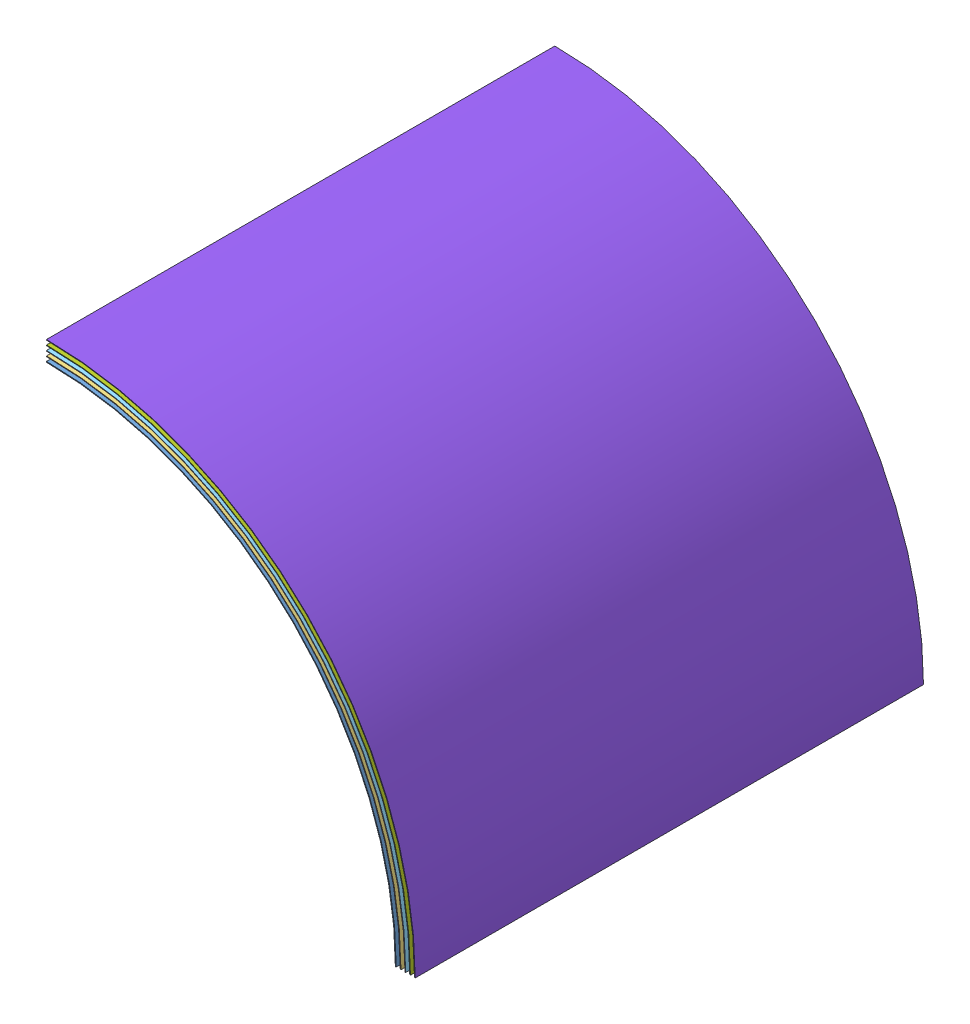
SolidWorks assembly NASA RASC-AL Whipple Shiled PRTYv3.SLDASM, configuration Default (file format 13000). Lengths in mm.
Overall size (2176 2176 3000).
8 component instances, 8 part files, 21 mates.
Components (placement in the parent):
- NASA RASC-AL Whipple Shield Rear Wall PRTYv3-1: NASA RASC-AL Whipple Shield Rear Wall PRTYv3.SLDPRT [Default] at (-265.9839 568.5624 3965.6767) size (2064 2064 3000)
- NASA RASC-AL Whipple Shield Kevlar 1 PRTYv3-1: NASA RASC-AL Whipple Shield Kevlar 1 PRTYv3.SLDPRT [Default] at (-265.9839 568.5624 3965.6767) size (2090 2090 3000)
- NASA RASC-AL Whipple Shield Nextol 1 PRTYv3-2: NASA RASC-AL Whipple Shield Nextol 1 PRTYv3.SLDPRT [Default] at (-265.9839 568.5624 3965.6767) size (2092 2092 3000)
- NASA RASC-AL Whipple Shield Kevlar 2 PRTYv3-1: NASA RASC-AL Whipple Shield Kevlar 2 PRTYv3.SLDPRT [Default] at (-265.9839 568.5624 3965.6767) size (2118 2118 3000)
- NASA RASC-AL Whipple Shield Nextol 2 PRTYv3-1: NASA RASC-AL Whipple Shield Nextol 2 PRTYv3.SLDPRT [Default] at (-265.9839 568.5624 3965.6767) size (2120 2120 3000)
- NASA RASC-AL Whipple Shield Kevlar 3 PRTYv3-1: NASA RASC-AL Whipple Shield Kevlar 3 PRTYv3.SLDPRT [Default] at (-265.9839 568.5624 3965.6767) size (2146 2146 3000)
- NASA RASC-AL Whipple Shield Nextol 3 PRTYv3-1: NASA RASC-AL Whipple Shield Nextol 3 PRTYv3.SLDPRT [Default] at (-265.9839 568.5624 3965.6767) size (2148 2148 3000)
- NASA RASC-AL Whipple Shield Front Bummper PRTYv3-1: NASA RASC-AL Whipple Shield Front Bummper PRTYv3.SLDPRT [Default] at (-265.9839 568.5624 3965.6767) size (2176 2176 3000)
Mates (geometry in assembly coordinates):
- Concentric1: concentric aligned: cylinder of NASA RASC-AL Whipple Shield Rear Wall PRTYv3-1 through (-265.9839 568.5624 965.6767) axis (0 0 1) radius 2064; cylinder of NASA RASC-AL Whipple Shield Kevlar 1 PRTYv3-1 through (-265.9839 568.5624 965.6767) axis (0 0 1) radius 2088
- Coincident1: coincident aligned: plane of NASA RASC-AL Whipple Shield Rear Wall PRTYv3-1 through (-265.9839 568.5624 3965.6767) normal (0 0 1); plane of NASA RASC-AL Whipple Shield Kevlar 1 PRTYv3-1 through (-265.9839 568.5624 3965.6767) normal (0 0 1)
- Coincident2: coincident aligned: plane of NASA RASC-AL Whipple Shield Rear Wall PRTYv3-1 through (-265.9839 2632.5624 965.6767) normal (-1 0 0); plane of NASA RASC-AL Whipple Shield Kevlar 1 PRTYv3-1 through (-265.9839 2658.5624 965.6767) normal (-1 0 0)
- Concentric3: concentric aligned: cylinder of NASA RASC-AL Whipple Shield Kevlar 1 PRTYv3-1 through (-265.9839 568.5624 965.6767) axis (0 0 1) radius 2090; cylinder of NASA RASC-AL Whipple Shield Nextol 1 PRTYv3-2 through (-265.9839 568.5624 965.6767) axis (0 0 1) radius 2090
- Coincident3: coincident aligned: plane of NASA RASC-AL Whipple Shield Kevlar 1 PRTYv3-1 through (-265.9839 568.5624 3965.6767) normal (0 0 1); plane of NASA RASC-AL Whipple Shield Nextol 1 PRTYv3-2 through (-265.9839 568.5624 3965.6767) normal (0 0 1)
- Coincident4: coincident aligned: plane of NASA RASC-AL Whipple Shield Kevlar 1 PRTYv3-1 through (-265.9839 2658.5624 965.6767) normal (-1 0 0); plane of NASA RASC-AL Whipple Shield Nextol 1 PRTYv3-2 through (-265.9839 2660.5624 965.6767) normal (-1 0 0)
- Concentric4: concentric aligned: cylinder of NASA RASC-AL Whipple Shield Nextol 1 PRTYv3-2 through (-265.9839 568.5624 965.6767) axis (0 0 1) radius 2092; cylinder of NASA RASC-AL Whipple Shield Kevlar 2 PRTYv3-1 through (-265.9839 568.5624 965.6767) axis (0 0 1) radius 2116
- Coincident5: coincident aligned: plane of NASA RASC-AL Whipple Shield Rear Wall PRTYv3-1 through (-265.9839 2632.5624 965.6767) normal (-1 0 0); plane of NASA RASC-AL Whipple Shield Kevlar 2 PRTYv3-1 through (-265.9839 2686.5624 965.6767) normal (-1 0 0)
- Coincident6: coincident aligned: plane of NASA RASC-AL Whipple Shield Nextol 1 PRTYv3-2 through (-265.9839 568.5624 3965.6767) normal (0 0 1); plane of NASA RASC-AL Whipple Shield Kevlar 2 PRTYv3-1 through (-265.9839 568.5624 3965.6767) normal (0 0 1)
- Concentric5: concentric aligned: cylinder of NASA RASC-AL Whipple Shield Kevlar 2 PRTYv3-1 through (-265.9839 568.5624 965.6767) axis (0 0 1) radius 2118; cylinder of NASA RASC-AL Whipple Shield Nextol 2 PRTYv3-1 through (-265.9839 568.5624 965.6767) axis (0 0 1) radius 2118
- Coincident7: coincident aligned: plane of NASA RASC-AL Whipple Shield Kevlar 2 PRTYv3-1 through (-265.9839 2686.5624 965.6767) normal (-1 0 0); plane of NASA RASC-AL Whipple Shield Nextol 2 PRTYv3-1 through (-265.9839 2688.5624 965.6767) normal (-1 0 0)
- Coincident8: coincident aligned: plane of NASA RASC-AL Whipple Shield Rear Wall PRTYv3-1 through (-265.9839 568.5624 3965.6767) normal (0 0 1); plane of NASA RASC-AL Whipple Shield Nextol 2 PRTYv3-1 through (-265.9839 568.5624 3965.6767) normal (0 0 1)
- Concentric6: concentric aligned: cylinder of NASA RASC-AL Whipple Shield Nextol 2 PRTYv3-1 through (-265.9839 568.5624 965.6767) axis (0 0 1) radius 2120; cylinder of NASA RASC-AL Whipple Shield Kevlar 3 PRTYv3-1 through (-265.9839 568.5624 965.6767) axis (0 0 1) radius 2144
- Coincident9: coincident aligned: plane of NASA RASC-AL Whipple Shield Rear Wall PRTYv3-1 through (-265.9839 2632.5624 965.6767) normal (-1 0 0); plane of NASA RASC-AL Whipple Shield Kevlar 3 PRTYv3-1 through (-265.9839 2714.5624 965.6767) normal (-1 0 0)
- Coincident10: coincident aligned: plane of NASA RASC-AL Whipple Shield Rear Wall PRTYv3-1 through (-265.9839 568.5624 3965.6767) normal (0 0 1); plane of NASA RASC-AL Whipple Shield Kevlar 3 PRTYv3-1 through (-265.9839 568.5624 3965.6767) normal (0 0 1)
- Concentric10: concentric aligned: cylinder of NASA RASC-AL Whipple Shield Kevlar 3 PRTYv3-1 through (-265.9839 568.5624 965.6767) axis (0 0 1) radius 2146; cylinder of NASA RASC-AL Whipple Shield Nextol 3 PRTYv3-1 through (-265.9839 568.5624 965.6767) axis (0 0 1) radius 2146
- Coincident14: coincident aligned: plane of NASA RASC-AL Whipple Shield Kevlar 3 PRTYv3-1 through (-265.9839 568.5624 3965.6767) normal (0 0 1); plane of NASA RASC-AL Whipple Shield Nextol 3 PRTYv3-1 through (-265.9839 568.5624 3965.6767) normal (0 0 1)
- Coincident15: coincident aligned: plane of NASA RASC-AL Whipple Shield Kevlar 3 PRTYv3-1 through (-265.9839 2714.5624 965.6767) normal (-1 0 0); plane of NASA RASC-AL Whipple Shield Nextol 3 PRTYv3-1 through (-265.9839 2716.5624 965.6767) normal (-1 0 0)
- Concentric11: concentric aligned: cylinder of NASA RASC-AL Whipple Shield Nextol 3 PRTYv3-1 through (-265.9839 568.5624 965.6767) axis (0 0 1) radius 2148; cylinder of NASA RASC-AL Whipple Shield Front Bummper PRTYv3-1 through (-265.9839 568.5624 965.6767) axis (0 0 1) radius 2172
- Coincident16: coincident aligned: plane of NASA RASC-AL Whipple Shield Nextol 3 PRTYv3-1 through (-265.9839 568.5624 3965.6767) normal (0 0 1); plane of NASA RASC-AL Whipple Shield Front Bummper PRTYv3-1 through (-265.9839 568.5624 3965.6767) normal (0 0 1)
- Coincident17: coincident aligned: plane of NASA RASC-AL Whipple Shield Nextol 3 PRTYv3-1 through (-265.9839 2716.5624 965.6767) normal (-1 0 0); plane of NASA RASC-AL Whipple Shield Front Bummper PRTYv3-1 through (-265.9839 2744.5624 965.6767) normal (-1 0 0)
